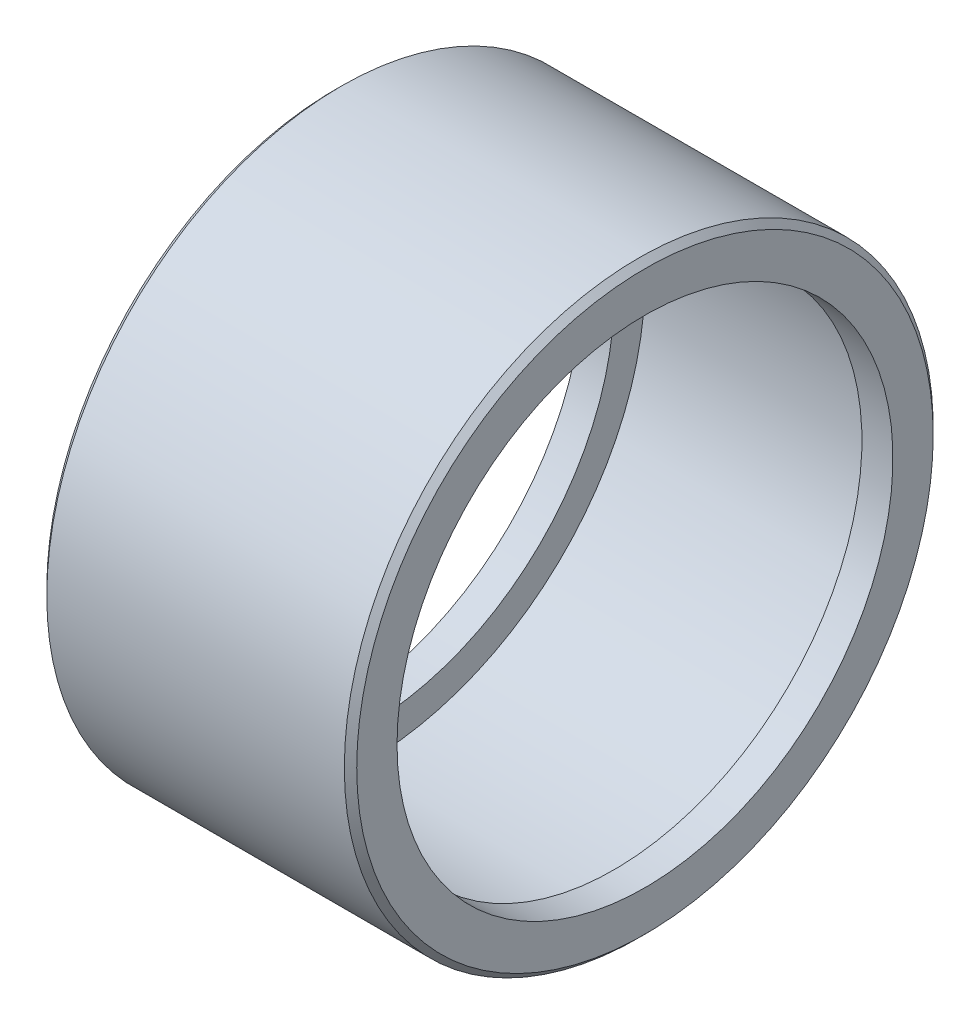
from build123d import *

# Parameters (mm, degrees)
CHANFREIN1_SIZE = 0.1


with BuildPart() as part:
    # Esquisse2 → R_volution1 (revolve)
    with BuildSketch(Plane.XY, mode=Mode.PRIVATE) as r_volution1_sk:
        Polygon((5, 4.75), (5, 4), (4.5, 4), (4.5, 4.5), (0.5, 4.5), (0.5, 4), (0, 4), (0, 4.75), align=None)
    revolve(r_volution1_sk.sketch.rotate(Axis((-4.556427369, 0, 0), (1, 0, 0)), 90), axis=Axis((-4.556427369, 0, 0), (1, 0, 0)))

    # Chanfrein1
    chanfrein1_edges = [part.edges().sort_by_distance(p)[0] for p in [
        (5, 0, -4.75),
        (0, 0, -4.75),
    ]]
    chamfer(chanfrein1_edges, length=CHANFREIN1_SIZE)


solid = part.part
